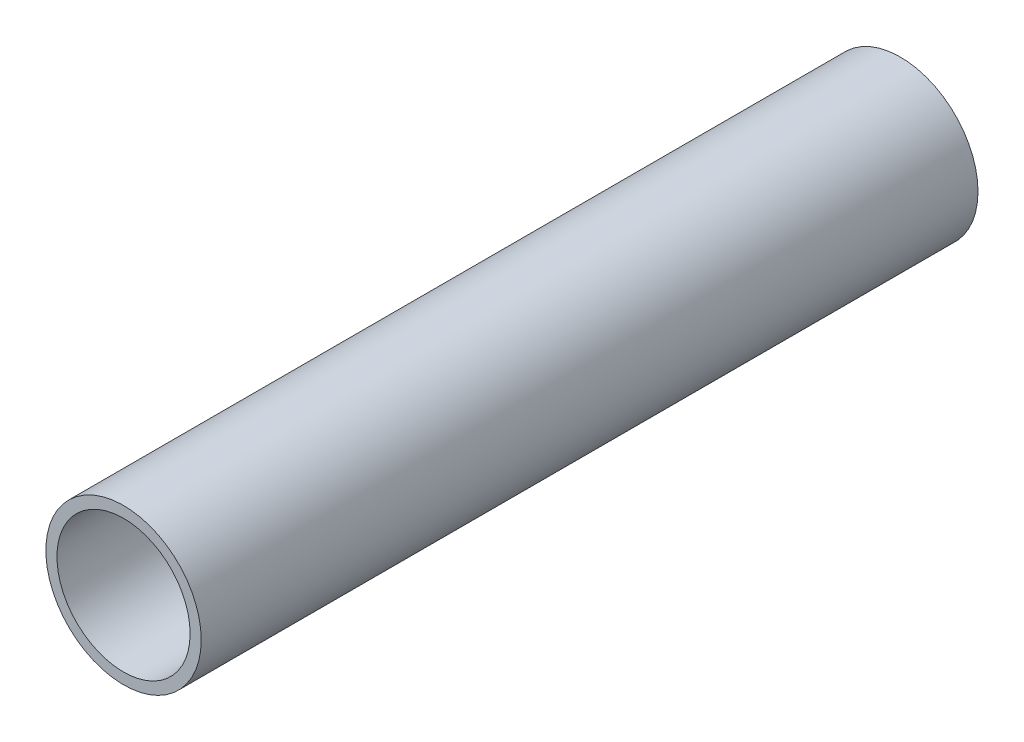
from build123d import *

# Parameters (mm, degrees)
ESQUISSE1_R      = 3.5
ESQUISSE1_R_2    = 3
EXTRUSION1_DEPTH = 35


with BuildPart() as part:
    # Esquisse1 → Extrusion1 (new body)
    with BuildSketch(Plane.XY):
        Circle(ESQUISSE1_R)
        Circle(ESQUISSE1_R_2, mode=Mode.SUBTRACT)
    extrude(amount=EXTRUSION1_DEPTH)


solid = part.part
